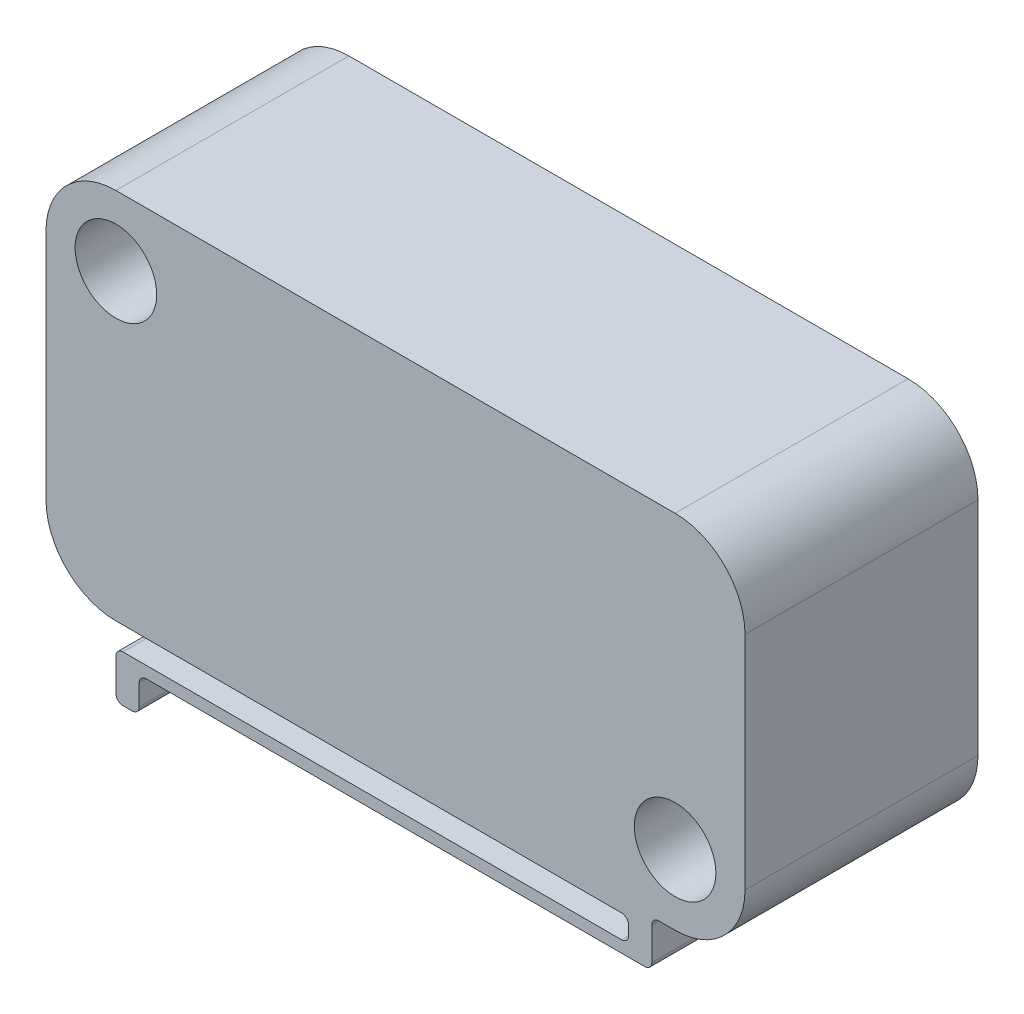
ISO-10303-21;
HEADER;
FILE_DESCRIPTION(('STEP AP214'),'2;1');
FILE_NAME('part.step','',(''),(''),'','','');
FILE_SCHEMA(('AUTOMOTIVE_DESIGN { 1 0 10303 214 1 1 1 1 }'));
ENDSEC;
DATA;
#1=APPLICATION_CONTEXT('core data for automotive mechanical design processes');
#2=APPLICATION_PROTOCOL_DEFINITION('international standard','automotive_design',2000,#1);
#3=PRODUCT_CONTEXT('',#1,'mechanical');
#4=PRODUCT('Part','Part','',(#3));
#5=PRODUCT_RELATED_PRODUCT_CATEGORY('part','',(#4));
#6=PRODUCT_DEFINITION_FORMATION('','',#4);
#7=PRODUCT_DEFINITION_CONTEXT('part definition',#1,'design');
#8=PRODUCT_DEFINITION('design','',#6,#7);
#9=PRODUCT_DEFINITION_SHAPE('','',#8);
#10=(LENGTH_UNIT() NAMED_UNIT(*) SI_UNIT(.MILLI.,.METRE.));
#11=(NAMED_UNIT(*) PLANE_ANGLE_UNIT() SI_UNIT($,.RADIAN.));
#12=(NAMED_UNIT(*) SI_UNIT($,.STERADIAN.) SOLID_ANGLE_UNIT());
#13=UNCERTAINTY_MEASURE_WITH_UNIT(LENGTH_MEASURE(1.E-05),#10,'distance_accuracy_value','');
#14=(GEOMETRIC_REPRESENTATION_CONTEXT(3) GLOBAL_UNCERTAINTY_ASSIGNED_CONTEXT((#13)) GLOBAL_UNIT_ASSIGNED_CONTEXT((#10,
#11,#12)) REPRESENTATION_CONTEXT('',''));
#15=CARTESIAN_POINT('',(0.,0.,0.));
#16=DIRECTION('',(0.,0.,1.));
#17=DIRECTION('',(1.,0.,0.));
#18=AXIS2_PLACEMENT_3D('',#15,#16,#17);
#19=CARTESIAN_POINT('',(27.,13.,10.));
#20=DIRECTION('',(0.,0.,1.));
#21=DIRECTION('',(1.,0.,0.));
#22=AXIS2_PLACEMENT_3D('',#19,#20,#21);
#23=PLANE('',#22);
#24=CARTESIAN_POINT('',(3.,13.,9.99999999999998));
#25=DIRECTION('',(0.,0.,1.));
#26=DIRECTION('',(1.,0.,0.));
#27=AXIS2_PLACEMENT_3D('',#24,#25,#26);
#28=CIRCLE('',#27,1.75);
#29=CARTESIAN_POINT('',(4.75,13.,9.99999999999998));
#30=VERTEX_POINT('',#29);
#31=EDGE_CURVE('E209',#30,#30,#28,.T.);
#32=ORIENTED_EDGE('',*,*,#31,.F.);
#33=EDGE_LOOP('',(#32));
#34=FACE_BOUND('',#33,.T.);
#35=CARTESIAN_POINT('',(27.,13.,10.));
#36=DIRECTION('',(0.,0.,1.));
#37=DIRECTION('',(1.,0.,0.));
#38=AXIS2_PLACEMENT_3D('',#35,#36,#37);
#39=CIRCLE('',#38,3.);
#40=CARTESIAN_POINT('',(30.,13.,10.));
#41=VERTEX_POINT('',#40);
#42=CARTESIAN_POINT('',(27.,16.,10.));
#43=VERTEX_POINT('',#42);
#44=EDGE_CURVE('E281',#41,#43,#39,.T.);
#45=ORIENTED_EDGE('',*,*,#44,.T.);
#46=DIRECTION('',(-1.,0.,0.));
#47=VECTOR('',#46,1.);
#48=CARTESIAN_POINT('',(27.,16.,10.));
#49=LINE('',#48,#47);
#50=CARTESIAN_POINT('',(3.,16.,9.99999999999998));
#51=VERTEX_POINT('',#50);
#52=EDGE_CURVE('E201',#43,#51,#49,.T.);
#53=ORIENTED_EDGE('',*,*,#52,.T.);
#54=CARTESIAN_POINT('',(3.,13.,9.99999999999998));
#55=DIRECTION('',(0.,0.,-1.));
#56=DIRECTION('',(-1.,0.,0.));
#57=AXIS2_PLACEMENT_3D('',#54,#55,#56);
#58=CIRCLE('',#57,3.);
#59=CARTESIAN_POINT('',(0.,13.,9.99999999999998));
#60=VERTEX_POINT('',#59);
#61=EDGE_CURVE('E284',#60,#51,#58,.T.);
#62=ORIENTED_EDGE('',*,*,#61,.F.);
#63=DIRECTION('',(0.,1.,0.));
#64=VECTOR('',#63,1.);
#65=CARTESIAN_POINT('',(0.,3.,10.));
#66=LINE('',#65,#64);
#67=CARTESIAN_POINT('',(0.,3.,10.));
#68=VERTEX_POINT('',#67);
#69=EDGE_CURVE('E287',#68,#60,#66,.T.);
#70=ORIENTED_EDGE('',*,*,#69,.F.);
#71=CARTESIAN_POINT('',(3.,3.,10.));
#72=DIRECTION('',(0.,0.,-1.));
#73=DIRECTION('',(-1.,0.,0.));
#74=AXIS2_PLACEMENT_3D('',#71,#72,#73);
#75=CIRCLE('',#74,3.);
#76=CARTESIAN_POINT('',(3.,0.,9.99999999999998));
#77=VERTEX_POINT('',#76);
#78=EDGE_CURVE('E290',#77,#68,#75,.T.);
#79=ORIENTED_EDGE('',*,*,#78,.F.);
#80=DIRECTION('',(1.,0.,0.));
#81=VECTOR('',#80,1.);
#82=CARTESIAN_POINT('',(3.,0.,9.99999999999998));
#83=LINE('',#82,#81);
#84=CARTESIAN_POINT('',(24.7,0.,9.99999999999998));
#85=VERTEX_POINT('',#84);
#86=EDGE_CURVE('E293',#77,#85,#83,.T.);
#87=ORIENTED_EDGE('',*,*,#86,.T.);
#88=CARTESIAN_POINT('',(24.7,-0.300000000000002,9.99999999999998));
#89=DIRECTION('',(0.,0.,-1.));
#90=DIRECTION('',(-1.,0.,0.));
#91=AXIS2_PLACEMENT_3D('',#88,#89,#90);
#92=CIRCLE('',#91,0.300000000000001);
#93=CARTESIAN_POINT('',(25.,-0.300000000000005,9.99999999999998));
#94=VERTEX_POINT('',#93);
#95=EDGE_CURVE('E296',#85,#94,#92,.T.);
#96=ORIENTED_EDGE('',*,*,#95,.T.);
#97=DIRECTION('',(0.,-1.,0.));
#98=VECTOR('',#97,1.);
#99=CARTESIAN_POINT('',(25.,-0.300000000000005,9.99999999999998));
#100=LINE('',#99,#98);
#101=CARTESIAN_POINT('',(25.,-0.700000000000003,9.99999999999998));
#102=VERTEX_POINT('',#101);
#103=EDGE_CURVE('E299',#94,#102,#100,.T.);
#104=ORIENTED_EDGE('',*,*,#103,.T.);
#105=CARTESIAN_POINT('',(24.7,-0.700000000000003,9.99999999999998));
#106=DIRECTION('',(0.,0.,1.));
#107=DIRECTION('',(1.,0.,0.));
#108=AXIS2_PLACEMENT_3D('',#105,#106,#107);
#109=CIRCLE('',#108,0.300000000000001);
#110=CARTESIAN_POINT('',(24.7,-1.,9.99999999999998));
#111=VERTEX_POINT('',#110);
#112=EDGE_CURVE('E302',#111,#102,#109,.T.);
#113=ORIENTED_EDGE('',*,*,#112,.F.);
#114=DIRECTION('',(-1.,0.,0.));
#115=VECTOR('',#114,1.);
#116=CARTESIAN_POINT('',(24.7,-1.,9.99999999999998));
#117=LINE('',#116,#115);
#118=CARTESIAN_POINT('',(3.30000000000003,-1.,9.99999999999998));
#119=VERTEX_POINT('',#118);
#120=EDGE_CURVE('E305',#111,#119,#117,.T.);
#121=ORIENTED_EDGE('',*,*,#120,.T.);
#122=CARTESIAN_POINT('',(3.29999999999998,-1.3,9.99999999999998));
#123=DIRECTION('',(0.,0.,-1.));
#124=DIRECTION('',(-1.,0.,0.));
#125=AXIS2_PLACEMENT_3D('',#122,#123,#124);
#126=CIRCLE('',#125,0.3);
#127=CARTESIAN_POINT('',(2.99999999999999,-1.3,9.99999999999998));
#128=VERTEX_POINT('',#127);
#129=EDGE_CURVE('E308',#128,#119,#126,.T.);
#130=ORIENTED_EDGE('',*,*,#129,.F.);
#131=DIRECTION('',(0.,-1.,0.));
#132=VECTOR('',#131,1.);
#133=CARTESIAN_POINT('',(2.99999999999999,-1.3,9.99999999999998));
#134=LINE('',#133,#132);
#135=CARTESIAN_POINT('',(2.99999999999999,-2.7,9.99999999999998));
#136=VERTEX_POINT('',#135);
#137=EDGE_CURVE('E311',#128,#136,#134,.T.);
#138=ORIENTED_EDGE('',*,*,#137,.T.);
#139=CARTESIAN_POINT('',(3.30000000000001,-2.7,9.99999999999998));
#140=DIRECTION('',(0.,0.,-1.));
#141=DIRECTION('',(-1.,0.,0.));
#142=AXIS2_PLACEMENT_3D('',#139,#140,#141);
#143=CIRCLE('',#142,0.299999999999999);
#144=CARTESIAN_POINT('',(3.30000000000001,-3.,9.99999999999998));
#145=VERTEX_POINT('',#144);
#146=EDGE_CURVE('E314',#145,#136,#143,.T.);
#147=ORIENTED_EDGE('',*,*,#146,.F.);
#148=DIRECTION('',(1.,0.,0.));
#149=VECTOR('',#148,1.);
#150=CARTESIAN_POINT('',(3.30000000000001,-3.,9.99999999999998));
#151=LINE('',#150,#149);
#152=CARTESIAN_POINT('',(3.69999999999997,-3.,9.99999999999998));
#153=VERTEX_POINT('',#152);
#154=EDGE_CURVE('E317',#145,#153,#151,.T.);
#155=ORIENTED_EDGE('',*,*,#154,.T.);
#156=CARTESIAN_POINT('',(3.69999999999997,-2.7,9.99999999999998));
#157=DIRECTION('',(0.,0.,-1.));
#158=DIRECTION('',(-1.,0.,0.));
#159=AXIS2_PLACEMENT_3D('',#156,#157,#158);
#160=CIRCLE('',#159,0.3);
#161=CARTESIAN_POINT('',(3.99999999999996,-2.70000000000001,9.99999999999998));
#162=VERTEX_POINT('',#161);
#163=EDGE_CURVE('E320',#162,#153,#160,.T.);
#164=ORIENTED_EDGE('',*,*,#163,.F.);
#165=DIRECTION('',(0.,1.,0.));
#166=VECTOR('',#165,1.);
#167=CARTESIAN_POINT('',(3.99999999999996,-2.70000000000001,9.99999999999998));
#168=LINE('',#167,#166);
#169=CARTESIAN_POINT('',(3.99999999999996,-1.8,9.99999999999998));
#170=VERTEX_POINT('',#169);
#171=EDGE_CURVE('E323',#162,#170,#168,.T.);
#172=ORIENTED_EDGE('',*,*,#171,.T.);
#173=CARTESIAN_POINT('',(4.29999999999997,-1.8,9.99999999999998));
#174=DIRECTION('',(0.,0.,-1.));
#175=DIRECTION('',(-1.,0.,0.));
#176=AXIS2_PLACEMENT_3D('',#173,#174,#175);
#177=CIRCLE('',#176,0.3);
#178=CARTESIAN_POINT('',(4.29999999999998,-1.5,9.99999999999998));
#179=VERTEX_POINT('',#178);
#180=EDGE_CURVE('E326',#170,#179,#177,.T.);
#181=ORIENTED_EDGE('',*,*,#180,.T.);
#182=DIRECTION('',(-1.,0.,0.));
#183=VECTOR('',#182,1.);
#184=CARTESIAN_POINT('',(25.7,-1.50000000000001,9.99999999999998));
#185=LINE('',#184,#183);
#186=CARTESIAN_POINT('',(25.7,-1.50000000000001,9.99999999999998));
#187=VERTEX_POINT('',#186);
#188=EDGE_CURVE('E329',#187,#179,#185,.T.);
#189=ORIENTED_EDGE('',*,*,#188,.F.);
#190=CARTESIAN_POINT('',(25.7,-1.2,9.99999999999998));
#191=DIRECTION('',(0.,0.,1.));
#192=DIRECTION('',(1.,0.,0.));
#193=AXIS2_PLACEMENT_3D('',#190,#191,#192);
#194=CIRCLE('',#193,0.300000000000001);
#195=CARTESIAN_POINT('',(26.,-1.20000000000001,9.99999999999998));
#196=VERTEX_POINT('',#195);
#197=EDGE_CURVE('E332',#187,#196,#194,.T.);
#198=ORIENTED_EDGE('',*,*,#197,.T.);
#199=DIRECTION('',(0.,-1.,0.));
#200=VECTOR('',#199,1.);
#201=CARTESIAN_POINT('',(26.,0.199999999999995,9.99999999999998));
#202=LINE('',#201,#200);
#203=CARTESIAN_POINT('',(26.,0.199999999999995,9.99999999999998));
#204=VERTEX_POINT('',#203);
#205=EDGE_CURVE('E335',#204,#196,#202,.T.);
#206=ORIENTED_EDGE('',*,*,#205,.F.);
#207=CARTESIAN_POINT('',(26.3,0.199999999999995,9.99999999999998));
#208=DIRECTION('',(0.,0.,-1.));
#209=DIRECTION('',(-1.,0.,0.));
#210=AXIS2_PLACEMENT_3D('',#207,#208,#209);
#211=CIRCLE('',#210,0.299999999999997);
#212=CARTESIAN_POINT('',(26.3,0.499999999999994,9.99999999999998));
#213=VERTEX_POINT('',#212);
#214=EDGE_CURVE('E338',#204,#213,#211,.T.);
#215=ORIENTED_EDGE('',*,*,#214,.T.);
#216=DIRECTION('',(-1.,0.,0.));
#217=VECTOR('',#216,1.);
#218=CARTESIAN_POINT('',(27.,0.49999999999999,9.99999999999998));
#219=LINE('',#218,#217);
#220=CARTESIAN_POINT('',(27.,0.49999999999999,9.99999999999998));
#221=VERTEX_POINT('',#220);
#222=EDGE_CURVE('E341',#221,#213,#219,.T.);
#223=ORIENTED_EDGE('',*,*,#222,.F.);
#224=CARTESIAN_POINT('',(27.,3.5,9.99999999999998));
#225=DIRECTION('',(0.,0.,-1.));
#226=DIRECTION('',(-1.,0.,0.));
#227=AXIS2_PLACEMENT_3D('',#224,#225,#226);
#228=CIRCLE('',#227,3.);
#229=CARTESIAN_POINT('',(30.,3.49999999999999,9.99999999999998));
#230=VERTEX_POINT('',#229);
#231=EDGE_CURVE('E344',#230,#221,#228,.T.);
#232=ORIENTED_EDGE('',*,*,#231,.F.);
#233=DIRECTION('',(0.,-1.,0.));
#234=VECTOR('',#233,1.);
#235=CARTESIAN_POINT('',(30.,13.,10.));
#236=LINE('',#235,#234);
#237=EDGE_CURVE('E346',#41,#230,#236,.T.);
#238=ORIENTED_EDGE('',*,*,#237,.F.);
#239=EDGE_LOOP('',(#45,#53,#62,#70,#79,#87,#96,#104,#113,#121,#130,#138,#147,#155,#164,#172,
#181,#189,#198,#206,#215,#223,#232,#238));
#240=FACE_BOUND('',#239,.T.);
#241=CARTESIAN_POINT('',(27.,3.5,9.99999999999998));
#242=DIRECTION('',(0.,0.,1.));
#243=DIRECTION('',(1.,0.,0.));
#244=AXIS2_PLACEMENT_3D('',#241,#242,#243);
#245=CIRCLE('',#244,1.75);
#246=CARTESIAN_POINT('',(28.75,3.5,9.99999999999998));
#247=VERTEX_POINT('',#246);
#248=EDGE_CURVE('E705',#247,#247,#245,.T.);
#249=ORIENTED_EDGE('',*,*,#248,.F.);
#250=EDGE_LOOP('',(#249));
#251=FACE_BOUND('',#250,.T.);
#252=ADVANCED_FACE('F34',(#34,#240,#251),#23,.T.);
#253=CARTESIAN_POINT('',(27.,13.,0.));
#254=DIRECTION('',(0.,0.,1.));
#255=DIRECTION('',(1.,0.,0.));
#256=AXIS2_PLACEMENT_3D('',#253,#254,#255);
#257=PLANE('',#256);
#258=CARTESIAN_POINT('',(3.,13.,0.));
#259=DIRECTION('',(0.,0.,1.));
#260=DIRECTION('',(1.,0.,0.));
#261=AXIS2_PLACEMENT_3D('',#258,#259,#260);
#262=CIRCLE('',#261,1.75);
#263=CARTESIAN_POINT('',(4.75,13.,0.));
#264=VERTEX_POINT('',#263);
#265=EDGE_CURVE('E710',#264,#264,#262,.T.);
#266=ORIENTED_EDGE('',*,*,#265,.T.);
#267=EDGE_LOOP('',(#266));
#268=FACE_BOUND('',#267,.T.);
#269=CARTESIAN_POINT('',(27.,13.,0.));
#270=DIRECTION('',(0.,0.,1.));
#271=DIRECTION('',(1.,0.,0.));
#272=AXIS2_PLACEMENT_3D('',#269,#270,#271);
#273=CIRCLE('',#272,3.);
#274=CARTESIAN_POINT('',(30.,13.,0.));
#275=VERTEX_POINT('',#274);
#276=CARTESIAN_POINT('',(27.,16.,0.));
#277=VERTEX_POINT('',#276);
#278=EDGE_CURVE('E205',#275,#277,#273,.T.);
#279=ORIENTED_EDGE('',*,*,#278,.F.);
#280=DIRECTION('',(0.,-1.,0.));
#281=VECTOR('',#280,1.);
#282=CARTESIAN_POINT('',(30.,13.,0.));
#283=LINE('',#282,#281);
#284=CARTESIAN_POINT('',(30.,3.5,0.));
#285=VERTEX_POINT('',#284);
#286=EDGE_CURVE('E279',#275,#285,#283,.T.);
#287=ORIENTED_EDGE('',*,*,#286,.T.);
#288=CARTESIAN_POINT('',(27.,3.5,0.));
#289=DIRECTION('',(0.,0.,-1.));
#290=DIRECTION('',(-1.,0.,0.));
#291=AXIS2_PLACEMENT_3D('',#288,#289,#290);
#292=CIRCLE('',#291,3.);
#293=CARTESIAN_POINT('',(27.,0.499999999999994,0.));
#294=VERTEX_POINT('',#293);
#295=EDGE_CURVE('E276',#285,#294,#292,.T.);
#296=ORIENTED_EDGE('',*,*,#295,.T.);
#297=DIRECTION('',(-1.,0.,0.));
#298=VECTOR('',#297,1.);
#299=CARTESIAN_POINT('',(27.,0.499999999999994,0.));
#300=LINE('',#299,#298);
#301=CARTESIAN_POINT('',(26.3,0.499999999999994,0.));
#302=VERTEX_POINT('',#301);
#303=EDGE_CURVE('E273',#294,#302,#300,.T.);
#304=ORIENTED_EDGE('',*,*,#303,.T.);
#305=CARTESIAN_POINT('',(26.3,0.199999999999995,0.));
#306=DIRECTION('',(0.,0.,-1.));
#307=DIRECTION('',(-1.,0.,0.));
#308=AXIS2_PLACEMENT_3D('',#305,#306,#307);
#309=CIRCLE('',#308,0.299999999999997);
#310=CARTESIAN_POINT('',(26.,0.199999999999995,0.));
#311=VERTEX_POINT('',#310);
#312=EDGE_CURVE('E270',#311,#302,#309,.T.);
#313=ORIENTED_EDGE('',*,*,#312,.F.);
#314=DIRECTION('',(0.,-1.,0.));
#315=VECTOR('',#314,1.);
#316=CARTESIAN_POINT('',(26.,0.199999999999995,0.));
#317=LINE('',#316,#315);
#318=CARTESIAN_POINT('',(26.,-1.20000000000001,0.));
#319=VERTEX_POINT('',#318);
#320=EDGE_CURVE('E267',#311,#319,#317,.T.);
#321=ORIENTED_EDGE('',*,*,#320,.T.);
#322=CARTESIAN_POINT('',(25.7,-1.2,0.));
#323=DIRECTION('',(0.,0.,1.));
#324=DIRECTION('',(1.,0.,0.));
#325=AXIS2_PLACEMENT_3D('',#322,#323,#324);
#326=CIRCLE('',#325,0.300000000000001);
#327=CARTESIAN_POINT('',(25.7,-1.50000000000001,0.));
#328=VERTEX_POINT('',#327);
#329=EDGE_CURVE('E264',#328,#319,#326,.T.);
#330=ORIENTED_EDGE('',*,*,#329,.F.);
#331=DIRECTION('',(-1.,0.,0.));
#332=VECTOR('',#331,1.);
#333=CARTESIAN_POINT('',(25.7,-1.50000000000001,0.));
#334=LINE('',#333,#332);
#335=CARTESIAN_POINT('',(4.29999999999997,-1.5,0.));
#336=VERTEX_POINT('',#335);
#337=EDGE_CURVE('E261',#328,#336,#334,.T.);
#338=ORIENTED_EDGE('',*,*,#337,.T.);
#339=CARTESIAN_POINT('',(4.29999999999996,-1.8,0.));
#340=DIRECTION('',(0.,0.,-1.));
#341=DIRECTION('',(-1.,0.,0.));
#342=AXIS2_PLACEMENT_3D('',#339,#340,#341);
#343=CIRCLE('',#342,0.3);
#344=CARTESIAN_POINT('',(3.99999999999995,-1.8,0.));
#345=VERTEX_POINT('',#344);
#346=EDGE_CURVE('E258',#345,#336,#343,.T.);
#347=ORIENTED_EDGE('',*,*,#346,.F.);
#348=DIRECTION('',(0.,1.,0.));
#349=VECTOR('',#348,1.);
#350=CARTESIAN_POINT('',(3.99999999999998,-2.70000000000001,0.));
#351=LINE('',#350,#349);
#352=CARTESIAN_POINT('',(3.99999999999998,-2.70000000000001,0.));
#353=VERTEX_POINT('',#352);
#354=EDGE_CURVE('E255',#353,#345,#351,.T.);
#355=ORIENTED_EDGE('',*,*,#354,.F.);
#356=CARTESIAN_POINT('',(3.69999999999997,-2.7,0.));
#357=DIRECTION('',(0.,0.,-1.));
#358=DIRECTION('',(-1.,0.,0.));
#359=AXIS2_PLACEMENT_3D('',#356,#357,#358);
#360=CIRCLE('',#359,0.3);
#361=CARTESIAN_POINT('',(3.69999999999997,-3.,0.));
#362=VERTEX_POINT('',#361);
#363=EDGE_CURVE('E252',#353,#362,#360,.T.);
#364=ORIENTED_EDGE('',*,*,#363,.T.);
#365=DIRECTION('',(1.,0.,0.));
#366=VECTOR('',#365,1.);
#367=CARTESIAN_POINT('',(3.30000000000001,-3.,0.));
#368=LINE('',#367,#366);
#369=CARTESIAN_POINT('',(3.30000000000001,-3.,0.));
#370=VERTEX_POINT('',#369);
#371=EDGE_CURVE('E249',#370,#362,#368,.T.);
#372=ORIENTED_EDGE('',*,*,#371,.F.);
#373=CARTESIAN_POINT('',(3.30000000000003,-2.7,0.));
#374=DIRECTION('',(0.,0.,-1.));
#375=DIRECTION('',(-1.,0.,0.));
#376=AXIS2_PLACEMENT_3D('',#373,#374,#375);
#377=CIRCLE('',#376,0.299999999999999);
#378=CARTESIAN_POINT('',(2.99999999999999,-2.7,0.));
#379=VERTEX_POINT('',#378);
#380=EDGE_CURVE('E246',#370,#379,#377,.T.);
#381=ORIENTED_EDGE('',*,*,#380,.T.);
#382=DIRECTION('',(0.,-1.,0.));
#383=VECTOR('',#382,1.);
#384=CARTESIAN_POINT('',(2.99999999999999,-1.3,0.));
#385=LINE('',#384,#383);
#386=CARTESIAN_POINT('',(2.99999999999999,-1.3,0.));
#387=VERTEX_POINT('',#386);
#388=EDGE_CURVE('E243',#387,#379,#385,.T.);
#389=ORIENTED_EDGE('',*,*,#388,.F.);
#390=CARTESIAN_POINT('',(3.30000000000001,-1.3,0.));
#391=DIRECTION('',(0.,0.,-1.));
#392=DIRECTION('',(-1.,0.,0.));
#393=AXIS2_PLACEMENT_3D('',#390,#391,#392);
#394=CIRCLE('',#393,0.3);
#395=CARTESIAN_POINT('',(3.30000000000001,-1.,0.));
#396=VERTEX_POINT('',#395);
#397=EDGE_CURVE('E240',#387,#396,#394,.T.);
#398=ORIENTED_EDGE('',*,*,#397,.T.);
#399=DIRECTION('',(-1.,0.,0.));
#400=VECTOR('',#399,1.);
#401=CARTESIAN_POINT('',(24.7,-1.,0.));
#402=LINE('',#401,#400);
#403=CARTESIAN_POINT('',(24.7,-1.,0.));
#404=VERTEX_POINT('',#403);
#405=EDGE_CURVE('E237',#404,#396,#402,.T.);
#406=ORIENTED_EDGE('',*,*,#405,.F.);
#407=CARTESIAN_POINT('',(24.7,-0.699999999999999,0.));
#408=DIRECTION('',(0.,0.,1.));
#409=DIRECTION('',(1.,0.,0.));
#410=AXIS2_PLACEMENT_3D('',#407,#408,#409);
#411=CIRCLE('',#410,0.300000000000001);
#412=CARTESIAN_POINT('',(25.,-0.700000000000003,0.));
#413=VERTEX_POINT('',#412);
#414=EDGE_CURVE('E234',#404,#413,#411,.T.);
#415=ORIENTED_EDGE('',*,*,#414,.T.);
#416=DIRECTION('',(0.,-1.,0.));
#417=VECTOR('',#416,1.);
#418=CARTESIAN_POINT('',(25.,-0.300000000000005,0.));
#419=LINE('',#418,#417);
#420=CARTESIAN_POINT('',(25.,-0.300000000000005,0.));
#421=VERTEX_POINT('',#420);
#422=EDGE_CURVE('E231',#421,#413,#419,.T.);
#423=ORIENTED_EDGE('',*,*,#422,.F.);
#424=CARTESIAN_POINT('',(24.7,-0.300000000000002,0.));
#425=DIRECTION('',(0.,0.,-1.));
#426=DIRECTION('',(-1.,0.,0.));
#427=AXIS2_PLACEMENT_3D('',#424,#425,#426);
#428=CIRCLE('',#427,0.300000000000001);
#429=CARTESIAN_POINT('',(24.7,0.,0.));
#430=VERTEX_POINT('',#429);
#431=EDGE_CURVE('E228',#430,#421,#428,.T.);
#432=ORIENTED_EDGE('',*,*,#431,.F.);
#433=DIRECTION('',(1.,0.,0.));
#434=VECTOR('',#433,1.);
#435=CARTESIAN_POINT('',(3.00000000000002,0.,0.));
#436=LINE('',#435,#434);
#437=CARTESIAN_POINT('',(3.00000000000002,0.,0.));
#438=VERTEX_POINT('',#437);
#439=EDGE_CURVE('E225',#438,#430,#436,.T.);
#440=ORIENTED_EDGE('',*,*,#439,.F.);
#441=CARTESIAN_POINT('',(3.,3.,0.));
#442=DIRECTION('',(0.,0.,-1.));
#443=DIRECTION('',(-1.,0.,0.));
#444=AXIS2_PLACEMENT_3D('',#441,#442,#443);
#445=CIRCLE('',#444,3.);
#446=CARTESIAN_POINT('',(0.,3.,0.));
#447=VERTEX_POINT('',#446);
#448=EDGE_CURVE('E222',#438,#447,#445,.T.);
#449=ORIENTED_EDGE('',*,*,#448,.T.);
#450=DIRECTION('',(0.,1.,0.));
#451=VECTOR('',#450,1.);
#452=CARTESIAN_POINT('',(0.,3.,0.));
#453=LINE('',#452,#451);
#454=CARTESIAN_POINT('',(0.,13.,0.));
#455=VERTEX_POINT('',#454);
#456=EDGE_CURVE('E217',#447,#455,#453,.T.);
#457=ORIENTED_EDGE('',*,*,#456,.T.);
#458=CARTESIAN_POINT('',(3.,13.,0.));
#459=DIRECTION('',(0.,0.,-1.));
#460=DIRECTION('',(-1.,0.,0.));
#461=AXIS2_PLACEMENT_3D('',#458,#459,#460);
#462=CIRCLE('',#461,3.);
#463=CARTESIAN_POINT('',(3.,16.,0.));
#464=VERTEX_POINT('',#463);
#465=EDGE_CURVE('E215',#455,#464,#462,.T.);
#466=ORIENTED_EDGE('',*,*,#465,.T.);
#467=DIRECTION('',(-1.,0.,0.));
#468=VECTOR('',#467,1.);
#469=CARTESIAN_POINT('',(27.,16.,0.));
#470=LINE('',#469,#468);
#471=EDGE_CURVE('E198',#277,#464,#470,.T.);
#472=ORIENTED_EDGE('',*,*,#471,.F.);
#473=EDGE_LOOP('',(#279,#287,#296,#304,#313,#321,#330,#338,#347,#355,#364,#372,#381,#389,#398,
#406,#415,#423,#432,#440,#449,#457,#466,#472));
#474=FACE_BOUND('',#473,.T.);
#475=CARTESIAN_POINT('',(27.,3.5,0.));
#476=DIRECTION('',(0.,0.,1.));
#477=DIRECTION('',(1.,0.,0.));
#478=AXIS2_PLACEMENT_3D('',#475,#476,#477);
#479=CIRCLE('',#478,1.75);
#480=CARTESIAN_POINT('',(28.75,3.5,0.));
#481=VERTEX_POINT('',#480);
#482=EDGE_CURVE('E708',#481,#481,#479,.T.);
#483=ORIENTED_EDGE('',*,*,#482,.T.);
#484=EDGE_LOOP('',(#483));
#485=FACE_BOUND('',#484,.T.);
#486=ADVANCED_FACE('F211',(#268,#474,#485),#257,.F.);
#487=CARTESIAN_POINT('',(27.,13.,10.));
#488=DIRECTION('',(0.,0.,-1.));
#489=DIRECTION('',(-1.,0.,0.));
#490=AXIS2_PLACEMENT_3D('',#487,#488,#489);
#491=CYLINDRICAL_SURFACE('',#490,3.);
#492=DIRECTION('',(0.,0.,-1.));
#493=VECTOR('',#492,1.);
#494=CARTESIAN_POINT('',(27.,16.,10.));
#495=LINE('',#494,#493);
#496=EDGE_CURVE('E11',#43,#277,#495,.T.);
#497=ORIENTED_EDGE('',*,*,#496,.F.);
#498=ORIENTED_EDGE('',*,*,#44,.F.);
#499=DIRECTION('',(0.,0.,-1.));
#500=VECTOR('',#499,1.);
#501=CARTESIAN_POINT('',(30.,13.,10.));
#502=LINE('',#501,#500);
#503=EDGE_CURVE('E49',#41,#275,#502,.T.);
#504=ORIENTED_EDGE('',*,*,#503,.T.);
#505=ORIENTED_EDGE('',*,*,#278,.T.);
#506=EDGE_LOOP('',(#497,#498,#504,#505));
#507=FACE_BOUND('',#506,.T.);
#508=ADVANCED_FACE('F206',(#507),#491,.T.);
#509=CARTESIAN_POINT('',(27.,16.,10.));
#510=DIRECTION('',(0.,-1.,0.));
#511=DIRECTION('',(0.,0.,-1.));
#512=AXIS2_PLACEMENT_3D('',#509,#510,#511);
#513=PLANE('',#512);
#514=DIRECTION('',(0.,0.,-1.));
#515=VECTOR('',#514,1.);
#516=CARTESIAN_POINT('',(3.,16.,9.99999999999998));
#517=LINE('',#516,#515);
#518=EDGE_CURVE('E42',#51,#464,#517,.T.);
#519=ORIENTED_EDGE('',*,*,#518,.F.);
#520=ORIENTED_EDGE('',*,*,#52,.F.);
#521=ORIENTED_EDGE('',*,*,#496,.T.);
#522=ORIENTED_EDGE('',*,*,#471,.T.);
#523=EDGE_LOOP('',(#519,#520,#521,#522));
#524=FACE_BOUND('',#523,.T.);
#525=ADVANCED_FACE('F36',(#524),#513,.F.);
#526=CARTESIAN_POINT('',(3.,13.,9.99999999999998));
#527=DIRECTION('',(0.,0.,-1.));
#528=DIRECTION('',(-1.,0.,0.));
#529=AXIS2_PLACEMENT_3D('',#526,#527,#528);
#530=CYLINDRICAL_SURFACE('',#529,3.);
#531=DIRECTION('',(0.,0.,-1.));
#532=VECTOR('',#531,1.);
#533=CARTESIAN_POINT('',(0.,13.,9.99999999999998));
#534=LINE('',#533,#532);
#535=EDGE_CURVE('E388',#60,#455,#534,.T.);
#536=ORIENTED_EDGE('',*,*,#535,.F.);
#537=ORIENTED_EDGE('',*,*,#61,.T.);
#538=ORIENTED_EDGE('',*,*,#518,.T.);
#539=ORIENTED_EDGE('',*,*,#465,.F.);
#540=EDGE_LOOP('',(#536,#537,#538,#539));
#541=FACE_BOUND('',#540,.T.);
#542=ADVANCED_FACE('F390',(#541),#530,.T.);
#543=CARTESIAN_POINT('',(0.,3.,10.));
#544=DIRECTION('',(-1.,0.,0.));
#545=DIRECTION('',(0.,0.,1.));
#546=AXIS2_PLACEMENT_3D('',#543,#544,#545);
#547=PLANE('',#546);
#548=DIRECTION('',(0.,0.,-1.));
#549=VECTOR('',#548,1.);
#550=CARTESIAN_POINT('',(0.,3.,10.));
#551=LINE('',#550,#549);
#552=EDGE_CURVE('E386',#68,#447,#551,.T.);
#553=ORIENTED_EDGE('',*,*,#552,.F.);
#554=ORIENTED_EDGE('',*,*,#69,.T.);
#555=ORIENTED_EDGE('',*,*,#535,.T.);
#556=ORIENTED_EDGE('',*,*,#456,.F.);
#557=EDGE_LOOP('',(#553,#554,#555,#556));
#558=FACE_BOUND('',#557,.T.);
#559=ADVANCED_FACE('F472',(#558),#547,.T.);
#560=CARTESIAN_POINT('',(3.,3.,10.));
#561=DIRECTION('',(0.,0.,-1.));
#562=DIRECTION('',(-1.,0.,0.));
#563=AXIS2_PLACEMENT_3D('',#560,#561,#562);
#564=CYLINDRICAL_SURFACE('',#563,3.);
#565=DIRECTION('',(0.,0.,-1.));
#566=VECTOR('',#565,1.);
#567=CARTESIAN_POINT('',(3.,0.,9.99999999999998));
#568=LINE('',#567,#566);
#569=EDGE_CURVE('E384',#77,#438,#568,.T.);
#570=ORIENTED_EDGE('',*,*,#569,.F.);
#571=ORIENTED_EDGE('',*,*,#78,.T.);
#572=ORIENTED_EDGE('',*,*,#552,.T.);
#573=ORIENTED_EDGE('',*,*,#448,.F.);
#574=EDGE_LOOP('',(#570,#571,#572,#573));
#575=FACE_BOUND('',#574,.T.);
#576=ADVANCED_FACE('F469',(#575),#564,.T.);
#577=CARTESIAN_POINT('',(3.,0.,9.99999999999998));
#578=DIRECTION('',(0.,1.,0.));
#579=DIRECTION('',(0.,0.,1.));
#580=AXIS2_PLACEMENT_3D('',#577,#578,#579);
#581=PLANE('',#580);
#582=DIRECTION('',(0.,0.,-1.));
#583=VECTOR('',#582,1.);
#584=CARTESIAN_POINT('',(24.7,0.,9.99999999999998));
#585=LINE('',#584,#583);
#586=EDGE_CURVE('E382',#85,#430,#585,.T.);
#587=ORIENTED_EDGE('',*,*,#586,.F.);
#588=ORIENTED_EDGE('',*,*,#86,.F.);
#589=ORIENTED_EDGE('',*,*,#569,.T.);
#590=ORIENTED_EDGE('',*,*,#439,.T.);
#591=EDGE_LOOP('',(#587,#588,#589,#590));
#592=FACE_BOUND('',#591,.T.);
#593=ADVANCED_FACE('F465',(#592),#581,.F.);
#594=CARTESIAN_POINT('',(24.7,-0.300000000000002,9.99999999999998));
#595=DIRECTION('',(0.,0.,-1.));
#596=DIRECTION('',(-1.,0.,0.));
#597=AXIS2_PLACEMENT_3D('',#594,#595,#596);
#598=CYLINDRICAL_SURFACE('',#597,0.300000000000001);
#599=DIRECTION('',(0.,0.,-1.));
#600=VECTOR('',#599,1.);
#601=CARTESIAN_POINT('',(25.,-0.300000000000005,9.99999999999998));
#602=LINE('',#601,#600);
#603=EDGE_CURVE('E380',#94,#421,#602,.T.);
#604=ORIENTED_EDGE('',*,*,#603,.F.);
#605=ORIENTED_EDGE('',*,*,#95,.F.);
#606=ORIENTED_EDGE('',*,*,#586,.T.);
#607=ORIENTED_EDGE('',*,*,#431,.T.);
#608=EDGE_LOOP('',(#604,#605,#606,#607));
#609=FACE_BOUND('',#608,.T.);
#610=ADVANCED_FACE('F461',(#609),#598,.F.);
#611=CARTESIAN_POINT('',(25.,-0.300000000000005,9.99999999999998));
#612=DIRECTION('',(1.,0.,0.));
#613=DIRECTION('',(0.,0.,-1.));
#614=AXIS2_PLACEMENT_3D('',#611,#612,#613);
#615=PLANE('',#614);
#616=DIRECTION('',(0.,0.,-1.));
#617=VECTOR('',#616,1.);
#618=CARTESIAN_POINT('',(25.,-0.700000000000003,9.99999999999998));
#619=LINE('',#618,#617);
#620=EDGE_CURVE('E378',#102,#413,#619,.T.);
#621=ORIENTED_EDGE('',*,*,#620,.F.);
#622=ORIENTED_EDGE('',*,*,#103,.F.);
#623=ORIENTED_EDGE('',*,*,#603,.T.);
#624=ORIENTED_EDGE('',*,*,#422,.T.);
#625=EDGE_LOOP('',(#621,#622,#623,#624));
#626=FACE_BOUND('',#625,.T.);
#627=ADVANCED_FACE('F457',(#626),#615,.F.);
#628=CARTESIAN_POINT('',(24.7,-0.700000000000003,9.99999999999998));
#629=DIRECTION('',(0.,0.,-1.));
#630=DIRECTION('',(-1.,0.,0.));
#631=AXIS2_PLACEMENT_3D('',#628,#629,#630);
#632=CYLINDRICAL_SURFACE('',#631,0.300000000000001);
#633=DIRECTION('',(0.,0.,-1.));
#634=VECTOR('',#633,1.);
#635=CARTESIAN_POINT('',(24.7,-1.,9.99999999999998));
#636=LINE('',#635,#634);
#637=EDGE_CURVE('E376',#111,#404,#636,.T.);
#638=ORIENTED_EDGE('',*,*,#637,.F.);
#639=ORIENTED_EDGE('',*,*,#112,.T.);
#640=ORIENTED_EDGE('',*,*,#620,.T.);
#641=ORIENTED_EDGE('',*,*,#414,.F.);
#642=EDGE_LOOP('',(#638,#639,#640,#641));
#643=FACE_BOUND('',#642,.T.);
#644=ADVANCED_FACE('F454',(#643),#632,.F.);
#645=CARTESIAN_POINT('',(24.7,-1.,9.99999999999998));
#646=DIRECTION('',(0.,-1.,0.));
#647=DIRECTION('',(1.,0.,0.));
#648=AXIS2_PLACEMENT_3D('',#645,#646,#647);
#649=PLANE('',#648);
#650=DIRECTION('',(0.,0.,-1.));
#651=VECTOR('',#650,1.);
#652=CARTESIAN_POINT('',(3.30000000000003,-1.,9.99999999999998));
#653=LINE('',#652,#651);
#654=EDGE_CURVE('E374',#119,#396,#653,.T.);
#655=ORIENTED_EDGE('',*,*,#654,.F.);
#656=ORIENTED_EDGE('',*,*,#120,.F.);
#657=ORIENTED_EDGE('',*,*,#637,.T.);
#658=ORIENTED_EDGE('',*,*,#405,.T.);
#659=EDGE_LOOP('',(#655,#656,#657,#658));
#660=FACE_BOUND('',#659,.T.);
#661=ADVANCED_FACE('F450',(#660),#649,.F.);
#662=CARTESIAN_POINT('',(3.29999999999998,-1.3,9.99999999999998));
#663=DIRECTION('',(0.,0.,-1.));
#664=DIRECTION('',(-1.,0.,0.));
#665=AXIS2_PLACEMENT_3D('',#662,#663,#664);
#666=CYLINDRICAL_SURFACE('',#665,0.3);
#667=DIRECTION('',(0.,0.,-1.));
#668=VECTOR('',#667,1.);
#669=CARTESIAN_POINT('',(2.99999999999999,-1.3,9.99999999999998));
#670=LINE('',#669,#668);
#671=EDGE_CURVE('E372',#128,#387,#670,.T.);
#672=ORIENTED_EDGE('',*,*,#671,.F.);
#673=ORIENTED_EDGE('',*,*,#129,.T.);
#674=ORIENTED_EDGE('',*,*,#654,.T.);
#675=ORIENTED_EDGE('',*,*,#397,.F.);
#676=EDGE_LOOP('',(#672,#673,#674,#675));
#677=FACE_BOUND('',#676,.T.);
#678=ADVANCED_FACE('F445',(#677),#666,.T.);
#679=CARTESIAN_POINT('',(2.99999999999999,-1.3,9.99999999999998));
#680=DIRECTION('',(1.,0.,0.));
#681=DIRECTION('',(0.,1.,0.));
#682=AXIS2_PLACEMENT_3D('',#679,#680,#681);
#683=PLANE('',#682);
#684=DIRECTION('',(0.,0.,-1.));
#685=VECTOR('',#684,1.);
#686=CARTESIAN_POINT('',(2.99999999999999,-2.7,9.99999999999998));
#687=LINE('',#686,#685);
#688=EDGE_CURVE('E370',#136,#379,#687,.T.);
#689=ORIENTED_EDGE('',*,*,#688,.F.);
#690=ORIENTED_EDGE('',*,*,#137,.F.);
#691=ORIENTED_EDGE('',*,*,#671,.T.);
#692=ORIENTED_EDGE('',*,*,#388,.T.);
#693=EDGE_LOOP('',(#689,#690,#691,#692));
#694=FACE_BOUND('',#693,.T.);
#695=ADVANCED_FACE('F441',(#694),#683,.F.);
#696=CARTESIAN_POINT('',(3.30000000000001,-2.7,9.99999999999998));
#697=DIRECTION('',(0.,0.,-1.));
#698=DIRECTION('',(-1.,0.,0.));
#699=AXIS2_PLACEMENT_3D('',#696,#697,#698);
#700=CYLINDRICAL_SURFACE('',#699,0.299999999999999);
#701=DIRECTION('',(0.,0.,-1.));
#702=VECTOR('',#701,1.);
#703=CARTESIAN_POINT('',(3.30000000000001,-3.,9.99999999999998));
#704=LINE('',#703,#702);
#705=EDGE_CURVE('E368',#145,#370,#704,.T.);
#706=ORIENTED_EDGE('',*,*,#705,.F.);
#707=ORIENTED_EDGE('',*,*,#146,.T.);
#708=ORIENTED_EDGE('',*,*,#688,.T.);
#709=ORIENTED_EDGE('',*,*,#380,.F.);
#710=EDGE_LOOP('',(#706,#707,#708,#709));
#711=FACE_BOUND('',#710,.T.);
#712=ADVANCED_FACE('F437',(#711),#700,.T.);
#713=CARTESIAN_POINT('',(3.30000000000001,-3.,9.99999999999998));
#714=DIRECTION('',(0.,1.,0.));
#715=DIRECTION('',(-1.,0.,0.));
#716=AXIS2_PLACEMENT_3D('',#713,#714,#715);
#717=PLANE('',#716);
#718=DIRECTION('',(0.,0.,-1.));
#719=VECTOR('',#718,1.);
#720=CARTESIAN_POINT('',(3.69999999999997,-3.,9.99999999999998));
#721=LINE('',#720,#719);
#722=EDGE_CURVE('E366',#153,#362,#721,.T.);
#723=ORIENTED_EDGE('',*,*,#722,.F.);
#724=ORIENTED_EDGE('',*,*,#154,.F.);
#725=ORIENTED_EDGE('',*,*,#705,.T.);
#726=ORIENTED_EDGE('',*,*,#371,.T.);
#727=EDGE_LOOP('',(#723,#724,#725,#726));
#728=FACE_BOUND('',#727,.T.);
#729=ADVANCED_FACE('F433',(#728),#717,.F.);
#730=CARTESIAN_POINT('',(3.69999999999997,-2.7,9.99999999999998));
#731=DIRECTION('',(0.,0.,-1.));
#732=DIRECTION('',(-1.,0.,0.));
#733=AXIS2_PLACEMENT_3D('',#730,#731,#732);
#734=CYLINDRICAL_SURFACE('',#733,0.3);
#735=DIRECTION('',(0.,0.,-1.));
#736=VECTOR('',#735,1.);
#737=CARTESIAN_POINT('',(3.99999999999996,-2.70000000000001,9.99999999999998));
#738=LINE('',#737,#736);
#739=EDGE_CURVE('E364',#162,#353,#738,.T.);
#740=ORIENTED_EDGE('',*,*,#739,.F.);
#741=ORIENTED_EDGE('',*,*,#163,.T.);
#742=ORIENTED_EDGE('',*,*,#722,.T.);
#743=ORIENTED_EDGE('',*,*,#363,.F.);
#744=EDGE_LOOP('',(#740,#741,#742,#743));
#745=FACE_BOUND('',#744,.T.);
#746=ADVANCED_FACE('F430',(#745),#734,.T.);
#747=CARTESIAN_POINT('',(3.99999999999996,-2.70000000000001,9.99999999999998));
#748=DIRECTION('',(-1.,0.,0.));
#749=DIRECTION('',(0.,-1.,0.));
#750=AXIS2_PLACEMENT_3D('',#747,#748,#749);
#751=PLANE('',#750);
#752=DIRECTION('',(0.,0.,-1.));
#753=VECTOR('',#752,1.);
#754=CARTESIAN_POINT('',(3.99999999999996,-1.8,9.99999999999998));
#755=LINE('',#754,#753);
#756=EDGE_CURVE('E362',#170,#345,#755,.T.);
#757=ORIENTED_EDGE('',*,*,#756,.F.);
#758=ORIENTED_EDGE('',*,*,#171,.F.);
#759=ORIENTED_EDGE('',*,*,#739,.T.);
#760=ORIENTED_EDGE('',*,*,#354,.T.);
#761=EDGE_LOOP('',(#757,#758,#759,#760));
#762=FACE_BOUND('',#761,.T.);
#763=ADVANCED_FACE('F426',(#762),#751,.F.);
#764=CARTESIAN_POINT('',(4.29999999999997,-1.8,9.99999999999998));
#765=DIRECTION('',(0.,0.,-1.));
#766=DIRECTION('',(-1.,0.,0.));
#767=AXIS2_PLACEMENT_3D('',#764,#765,#766);
#768=CYLINDRICAL_SURFACE('',#767,0.3);
#769=DIRECTION('',(0.,0.,-1.));
#770=VECTOR('',#769,1.);
#771=CARTESIAN_POINT('',(4.29999999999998,-1.5,9.99999999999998));
#772=LINE('',#771,#770);
#773=EDGE_CURVE('E360',#179,#336,#772,.T.);
#774=ORIENTED_EDGE('',*,*,#773,.F.);
#775=ORIENTED_EDGE('',*,*,#180,.F.);
#776=ORIENTED_EDGE('',*,*,#756,.T.);
#777=ORIENTED_EDGE('',*,*,#346,.T.);
#778=EDGE_LOOP('',(#774,#775,#776,#777));
#779=FACE_BOUND('',#778,.T.);
#780=ADVANCED_FACE('F421',(#779),#768,.F.);
#781=CARTESIAN_POINT('',(25.7,-1.50000000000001,9.99999999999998));
#782=DIRECTION('',(0.,-1.,0.));
#783=DIRECTION('',(1.,0.,0.));
#784=AXIS2_PLACEMENT_3D('',#781,#782,#783);
#785=PLANE('',#784);
#786=DIRECTION('',(0.,0.,-1.));
#787=VECTOR('',#786,1.);
#788=CARTESIAN_POINT('',(25.7,-1.50000000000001,9.99999999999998));
#789=LINE('',#788,#787);
#790=EDGE_CURVE('E358',#187,#328,#789,.T.);
#791=ORIENTED_EDGE('',*,*,#790,.F.);
#792=ORIENTED_EDGE('',*,*,#188,.T.);
#793=ORIENTED_EDGE('',*,*,#773,.T.);
#794=ORIENTED_EDGE('',*,*,#337,.F.);
#795=EDGE_LOOP('',(#791,#792,#793,#794));
#796=FACE_BOUND('',#795,.T.);
#797=ADVANCED_FACE('F418',(#796),#785,.T.);
#798=CARTESIAN_POINT('',(25.7,-1.2,9.99999999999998));
#799=DIRECTION('',(0.,0.,-1.));
#800=DIRECTION('',(-1.,0.,0.));
#801=AXIS2_PLACEMENT_3D('',#798,#799,#800);
#802=CYLINDRICAL_SURFACE('',#801,0.300000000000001);
#803=DIRECTION('',(0.,0.,-1.));
#804=VECTOR('',#803,1.);
#805=CARTESIAN_POINT('',(26.,-1.20000000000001,9.99999999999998));
#806=LINE('',#805,#804);
#807=EDGE_CURVE('E356',#196,#319,#806,.T.);
#808=ORIENTED_EDGE('',*,*,#807,.F.);
#809=ORIENTED_EDGE('',*,*,#197,.F.);
#810=ORIENTED_EDGE('',*,*,#790,.T.);
#811=ORIENTED_EDGE('',*,*,#329,.T.);
#812=EDGE_LOOP('',(#808,#809,#810,#811));
#813=FACE_BOUND('',#812,.T.);
#814=ADVANCED_FACE('F414',(#813),#802,.T.);
#815=CARTESIAN_POINT('',(26.,0.199999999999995,9.99999999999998));
#816=DIRECTION('',(1.,0.,0.));
#817=DIRECTION('',(0.,1.,0.));
#818=AXIS2_PLACEMENT_3D('',#815,#816,#817);
#819=PLANE('',#818);
#820=DIRECTION('',(0.,0.,-1.));
#821=VECTOR('',#820,1.);
#822=CARTESIAN_POINT('',(26.,0.199999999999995,9.99999999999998));
#823=LINE('',#822,#821);
#824=EDGE_CURVE('E354',#204,#311,#823,.T.);
#825=ORIENTED_EDGE('',*,*,#824,.F.);
#826=ORIENTED_EDGE('',*,*,#205,.T.);
#827=ORIENTED_EDGE('',*,*,#807,.T.);
#828=ORIENTED_EDGE('',*,*,#320,.F.);
#829=EDGE_LOOP('',(#825,#826,#827,#828));
#830=FACE_BOUND('',#829,.T.);
#831=ADVANCED_FACE('F409',(#830),#819,.T.);
#832=CARTESIAN_POINT('',(26.3,0.199999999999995,9.99999999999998));
#833=DIRECTION('',(0.,0.,-1.));
#834=DIRECTION('',(-1.,0.,0.));
#835=AXIS2_PLACEMENT_3D('',#832,#833,#834);
#836=CYLINDRICAL_SURFACE('',#835,0.299999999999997);
#837=DIRECTION('',(0.,0.,-1.));
#838=VECTOR('',#837,1.);
#839=CARTESIAN_POINT('',(26.3,0.499999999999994,9.99999999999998));
#840=LINE('',#839,#838);
#841=EDGE_CURVE('E352',#213,#302,#840,.T.);
#842=ORIENTED_EDGE('',*,*,#841,.F.);
#843=ORIENTED_EDGE('',*,*,#214,.F.);
#844=ORIENTED_EDGE('',*,*,#824,.T.);
#845=ORIENTED_EDGE('',*,*,#312,.T.);
#846=EDGE_LOOP('',(#842,#843,#844,#845));
#847=FACE_BOUND('',#846,.T.);
#848=ADVANCED_FACE('F405',(#847),#836,.F.);
#849=CARTESIAN_POINT('',(27.,0.49999999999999,9.99999999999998));
#850=DIRECTION('',(0.,-1.,0.));
#851=DIRECTION('',(1.,0.,0.));
#852=AXIS2_PLACEMENT_3D('',#849,#850,#851);
#853=PLANE('',#852);
#854=DIRECTION('',(0.,0.,-1.));
#855=VECTOR('',#854,1.);
#856=CARTESIAN_POINT('',(27.,0.49999999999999,9.99999999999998));
#857=LINE('',#856,#855);
#858=EDGE_CURVE('E350',#221,#294,#857,.T.);
#859=ORIENTED_EDGE('',*,*,#858,.F.);
#860=ORIENTED_EDGE('',*,*,#222,.T.);
#861=ORIENTED_EDGE('',*,*,#841,.T.);
#862=ORIENTED_EDGE('',*,*,#303,.F.);
#863=EDGE_LOOP('',(#859,#860,#861,#862));
#864=FACE_BOUND('',#863,.T.);
#865=ADVANCED_FACE('F402',(#864),#853,.T.);
#866=CARTESIAN_POINT('',(27.,3.5,9.99999999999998));
#867=DIRECTION('',(0.,0.,-1.));
#868=DIRECTION('',(-1.,0.,0.));
#869=AXIS2_PLACEMENT_3D('',#866,#867,#868);
#870=CYLINDRICAL_SURFACE('',#869,3.);
#871=DIRECTION('',(0.,0.,-1.));
#872=VECTOR('',#871,1.);
#873=CARTESIAN_POINT('',(30.,3.49999999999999,9.99999999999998));
#874=LINE('',#873,#872);
#875=EDGE_CURVE('E57',#230,#285,#874,.T.);
#876=ORIENTED_EDGE('',*,*,#875,.F.);
#877=ORIENTED_EDGE('',*,*,#231,.T.);
#878=ORIENTED_EDGE('',*,*,#858,.T.);
#879=ORIENTED_EDGE('',*,*,#295,.F.);
#880=EDGE_LOOP('',(#876,#877,#878,#879));
#881=FACE_BOUND('',#880,.T.);
#882=ADVANCED_FACE('F398',(#881),#870,.T.);
#883=CARTESIAN_POINT('',(30.,13.,10.));
#884=DIRECTION('',(1.,0.,0.));
#885=DIRECTION('',(0.,0.,-1.));
#886=AXIS2_PLACEMENT_3D('',#883,#884,#885);
#887=PLANE('',#886);
#888=ORIENTED_EDGE('',*,*,#237,.T.);
#889=ORIENTED_EDGE('',*,*,#875,.T.);
#890=ORIENTED_EDGE('',*,*,#286,.F.);
#891=ORIENTED_EDGE('',*,*,#503,.F.);
#892=EDGE_LOOP('',(#888,#889,#890,#891));
#893=FACE_BOUND('',#892,.T.);
#894=ADVANCED_FACE('F397',(#893),#887,.T.);
#895=CARTESIAN_POINT('',(3.,13.,9.99999999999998));
#896=DIRECTION('',(0.,0.,-1.));
#897=DIRECTION('',(-1.,0.,0.));
#898=AXIS2_PLACEMENT_3D('',#895,#896,#897);
#899=CYLINDRICAL_SURFACE('',#898,1.75);
#900=ORIENTED_EDGE('',*,*,#31,.T.);
#901=EDGE_LOOP('',(#900));
#902=FACE_BOUND('',#901,.T.);
#903=ORIENTED_EDGE('',*,*,#265,.F.);
#904=EDGE_LOOP('',(#903));
#905=FACE_BOUND('',#904,.T.);
#906=ADVANCED_FACE('F495',(#902,#905),#899,.F.);
#907=CARTESIAN_POINT('',(27.,3.5,9.99999999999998));
#908=DIRECTION('',(0.,0.,-1.));
#909=DIRECTION('',(-1.,0.,0.));
#910=AXIS2_PLACEMENT_3D('',#907,#908,#909);
#911=CYLINDRICAL_SURFACE('',#910,1.75);
#912=ORIENTED_EDGE('',*,*,#248,.T.);
#913=EDGE_LOOP('',(#912));
#914=FACE_BOUND('',#913,.T.);
#915=ORIENTED_EDGE('',*,*,#482,.F.);
#916=EDGE_LOOP('',(#915));
#917=FACE_BOUND('',#916,.T.);
#918=ADVANCED_FACE('F613',(#914,#917),#911,.F.);
#919=CLOSED_SHELL('',(#252,#486,#508,#525,#542,#559,#576,#593,#610,#627,#644,#661,#678,#695,
#712,#729,#746,#763,#780,#797,#814,#831,#848,#865,#882,#894,#906,#918));
#920=MANIFOLD_SOLID_BREP('B2',#919);
#921=ADVANCED_BREP_SHAPE_REPRESENTATION('',(#18,#920),#14);
#922=SHAPE_DEFINITION_REPRESENTATION(#9,#921);
ENDSEC;
END-ISO-10303-21;
